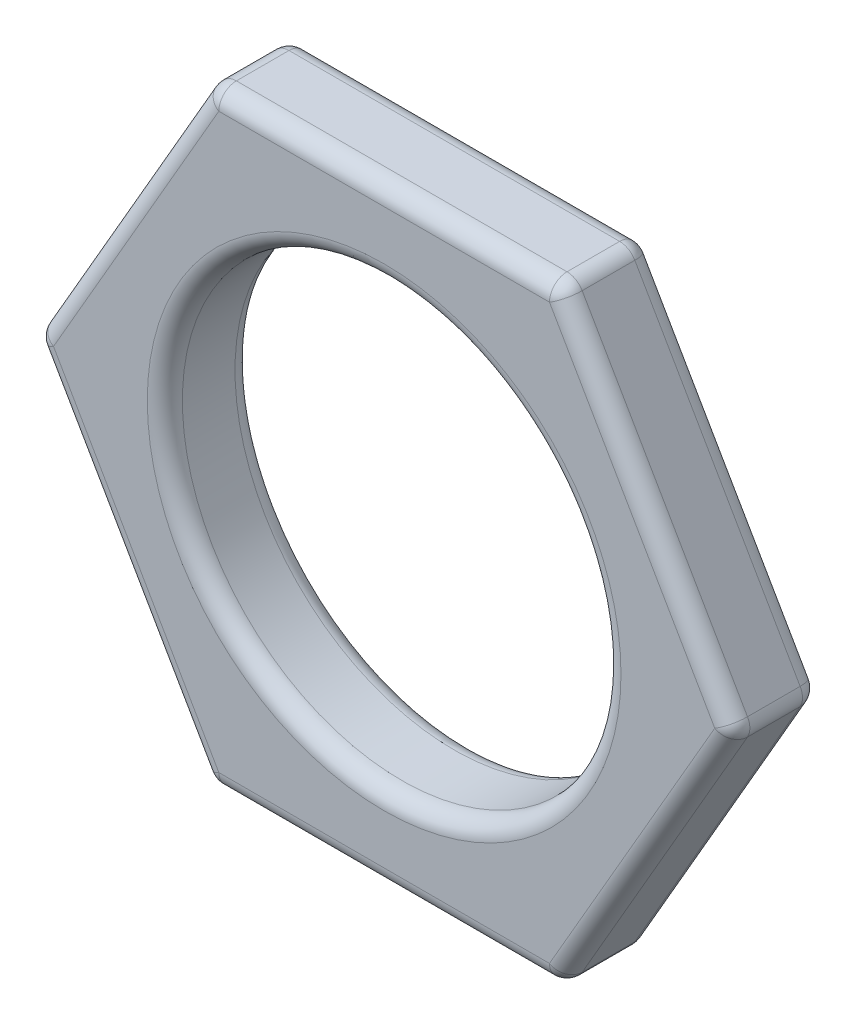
from build123d import *

# Parameters (mm, degrees)
SKETCH1_R      = 3.96875
EXTRUDE1_DEPTH = 1.5875
FILLET4_R      = 0.3175


with BuildPart() as part:
    # Sketch1 → Extrude1 (new body)
    with BuildSketch(Plane.XY):
        Polygon((6.35, 0), (3.175, 5.499261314), (-3.175, 5.499261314), (-6.35, 0), (-3.175, -5.499261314), (3.175, -5.499261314), align=None)
        Circle(SKETCH1_R, mode=Mode.SUBTRACT)
    extrude(amount=EXTRUDE1_DEPTH)

    # Fillet4
    fillet4_edges = [part.edges().sort_by_distance(p)[0] for p in [
        (0, 5.499261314, 1.5875),
        (3.175, -5.499261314, 0.79375),
        (-3.175, -5.499261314, 0.79375),
        (-6.35, 0, 0.79375),
        (-3.175, 5.499261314, 0.79375),
        (3.175, 5.499261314, 0.79375),
        (6.35, 0, 0.79375),
        (-4.7625, 2.749630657, 1.5875),
        (-4.7625, -2.749630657, 1.5875),
        (-3.96875, 0, 0),
        (-3.96875, 0, 1.5875),
        (0, -5.499261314, 1.5875),
        (4.7625, -2.749630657, 1.5875),
        (0, -5.499261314, 0),
        (-4.7625, -2.749630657, 0),
        (-4.7625, 2.749630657, 0),
        (4.7625, 2.749630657, 1.5875),
        (0, 5.499261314, 0),
        (4.7625, 2.749630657, 0),
        (4.7625, -2.749630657, 0),
    ]]
    fillet(fillet4_edges, radius=FILLET4_R)


solid = part.part
